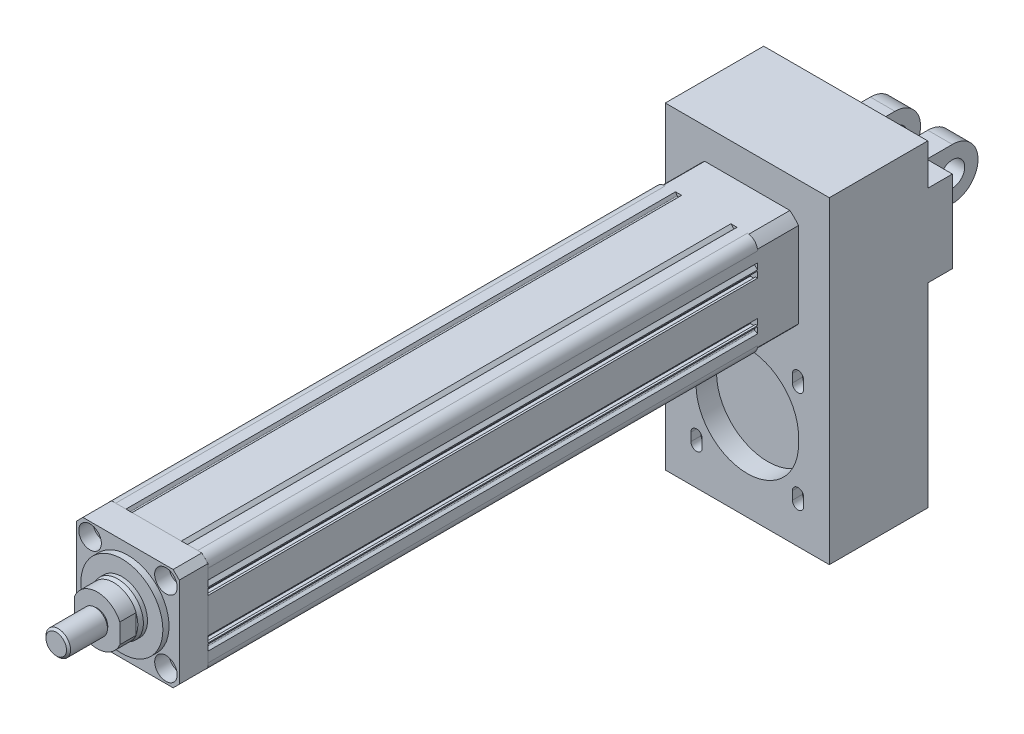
from build123d import *

# Parameters (mm, degrees)
SKETCH_1_R           = 20
SKETCH_1_R_2         = 2.75
EXTRUDE_1_DEPTH      = 268
FILLET_1_R           = 5
EXTRUDE_2_DEPTH      = 14
SKETCH_3_R           = 20
EXTRUDE_3_DEPTH      = 3
SKETCH_5_R           = 12.5
EXTRUDE_4_DEPTH      = 4
CHAMFER_1_SIZE       = 2
CHAMFER_1_SIZE2      = 0.7
EXTRUDE_5_DEPTH      = 8
SKETCH_7_R           = 5.15
EXTRUDE_6_DEPTH      = 1
SKETCH_8_R           = 6
EXTRUDE_7_DEPTH      = 19
CHAMFER_2_SIZE       = 1
SKETCH_23_W          = 50
SKETCH_23_H          = 50
EXTRUDE_8_DEPTH      = 20
SKETCH_24_R          = 42.5
SKETCH_24_R_2        = 32.5
CUT_EXTRUDE_1_DEPTH  = 20
SKETCH_4_R           = 3.5
CUT_EXTRUDE_5_DEPTH  = 30
SKETCH_4_6_R         = 5.5
CUT_EXTRUDE_6_DEPTH  = 7
SKETCH_35_W          = 80
SKETCH_35_H          = 155
EXTRUDE_10_DEPTH     = 48
CUT_EXTRUDE_11_DEPTH = 10
CUT_EXTRUDE_12_DEPTH = 10
CUT_EXTRUDE_START    = 10
CUT_EXTRUDE_13_DEPTH = 5
SKETCH_36_W          = 80
SKETCH_36_H          = 40
EXTRUDE_11_DEPTH     = 12
SKETCH_36_3_W        = 12
SKETCH_36_3_H        = 25
EXTRUDE_12_DEPTH     = 44.5
SKETCH_38_R          = 6
CUT_EXTRUDE_14_DEPTH = 44
CHAMFER_3_SIZE       = 2


with BuildPart() as part:
    # Sketch 1 → Extrude 1 (new body)
    with BuildSketch(Plane.XY):
        with BuildLine():
            Line((-25, 25), (-15, 25))
            Line((-15, 25), (-14.227730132, 23.662389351))
            ThreePointArc((-14.227730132, 23.662389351), (-13.859980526, 23.416666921), (-13.441164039, 23.558835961))
            Line((-13.441164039, 23.558835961), (-12, 25))
            Line((-12, 25), (12, 25))
            Line((12, 25), (13.441164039, 23.558835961))
            ThreePointArc((13.441164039, 23.558835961), (13.859980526, 23.416666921), (14.227730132, 23.662389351))
            Line((14.227730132, 23.662389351), (15, 25))
            Line((15, 25), (25, 25))
            Line((25, 25), (25, 15))
            Line((25, 15), (23.662389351, 14.227730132))
            ThreePointArc((23.662389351, 14.227730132), (23.416666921, 13.859980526), (23.558835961, 13.441164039))
            Line((23.558835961, 13.441164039), (25, 12))
            Line((25, 12), (25, 11.5))
            Line((25, 11.5), (24, 11.5))
            Line((24, 11.5), (24, 12.4))
            Line((24, 12.4), (21.5, 12.4))
            Line((21.5, 12.4), (21.5, 7.6))
            Line((21.5, 7.6), (24, 7.6))
            Line((24, 7.6), (24, 8.5))
            Line((24, 8.5), (25, 8.5))
            Line((25, 8.5), (25, -8.5))
            Line((25, -8.5), (24, -8.5))
            Line((24, -8.5), (24, -7.6))
            Line((24, -7.6), (21.5, -7.6))
            Line((21.5, -7.6), (21.5, -12.4))
            Line((21.5, -12.4), (24, -12.4))
            Line((24, -12.4), (24, -11.5))
            Line((24, -11.5), (25, -11.5))
            Line((25, -11.5), (25, -12))
            Line((25, -12), (23.558835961, -13.441164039))
            ThreePointArc((23.558835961, -13.441164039), (23.416666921, -13.859980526), (23.662389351, -14.227730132))
            Line((23.662389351, -14.227730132), (25, -15))
            Line((25, -15), (25, -25))
            Line((25, -25), (15, -25))
            Line((15, -25), (14.227730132, -23.662389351))
            ThreePointArc((14.227730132, -23.662389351), (13.859980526, -23.416666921), (13.441164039, -23.558835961))
            Line((13.441164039, -23.558835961), (12, -25))
            Line((12, -25), (11.5, -25))
            Line((11.5, -25), (11.5, -24))
            Line((11.5, -24), (12.4, -24))
            Line((12.4, -24), (12.4, -21.5))
            Line((12.4, -21.5), (7.6, -21.5))
            Line((7.6, -21.5), (7.6, -24))
            Line((7.6, -24), (8.5, -24))
            Line((8.5, -24), (8.5, -25))
            Line((8.5, -25), (-8.5, -25))
            Line((-8.5, -25), (-8.5, -24))
            Line((-8.5, -24), (-7.6, -24))
            Line((-7.6, -24), (-7.6, -21.5))
            Line((-7.6, -21.5), (-12.4, -21.5))
            Line((-12.4, -21.5), (-12.4, -24))
            Line((-12.4, -24), (-11.5, -24))
            Line((-11.5, -24), (-11.5, -25))
            Line((-11.5, -25), (-12, -25))
            Line((-12, -25), (-13.441164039, -23.558835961))
            ThreePointArc((-13.441164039, -23.558835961), (-13.859980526, -23.416666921), (-14.227730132, -23.662389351))
            Line((-14.227730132, -23.662389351), (-15, -25))
            Line((-15, -25), (-25, -25))
            Line((-25, -25), (-25, -15))
            Line((-25, -15), (-23.662389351, -14.227730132))
            ThreePointArc((-23.662389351, -14.227730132), (-23.416666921, -13.859980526), (-23.558835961, -13.441164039))
            Line((-23.558835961, -13.441164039), (-25, -12))
            Line((-25, -12), (-25, -11.5))
            Line((-25, -11.5), (-24, -11.5))
            Line((-24, -11.5), (-24, -12.4))
            Line((-24, -12.4), (-21.5, -12.4))
            Line((-21.5, -12.4), (-21.5, -7.6))
            Line((-21.5, -7.6), (-24, -7.6))
            Line((-24, -7.6), (-24, -8.5))
            Line((-24, -8.5), (-25, -8.5))
            Line((-25, -8.5), (-25, 8.5))
            Line((-25, 8.5), (-24, 8.5))
            Line((-24, 8.5), (-24, 7.6))
            Line((-24, 7.6), (-21.5, 7.6))
            Line((-21.5, 7.6), (-21.5, 12.4))
            Line((-21.5, 12.4), (-24, 12.4))
            Line((-24, 12.4), (-24, 11.5))
            Line((-24, 11.5), (-25, 11.5))
            Line((-25, 11.5), (-25, 12))
            Line((-25, 12), (-23.558835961, 13.441164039))
            ThreePointArc((-23.558835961, 13.441164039), (-23.416666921, 13.859980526), (-23.662389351, 14.227730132))
            Line((-23.662389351, 14.227730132), (-25, 15))
            Line((-25, 15), (-25, 25))
        make_face()
        Circle(SKETCH_1_R, mode=Mode.SUBTRACT)
        with Locations((-18.5, 18.5)):
            Circle(SKETCH_1_R_2, mode=Mode.SUBTRACT)
        with Locations((18.5, 18.5)):
            Circle(SKETCH_1_R_2, mode=Mode.SUBTRACT)
        with Locations((18.5, -18.5)):
            Circle(SKETCH_1_R_2, mode=Mode.SUBTRACT)
        with Locations((-18.5, -18.5)):
            Circle(SKETCH_1_R_2, mode=Mode.SUBTRACT)
        with BuildLine():
            Line((-13.868836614, 23), (-5, 23))
            ThreePointArc((-5, 23), (-4.502985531, 22.554558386), (-4.891534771, 22.01190647))
            ThreePointArc((-4.891534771, 22.01190647), (-10.498377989, 19.955831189), (-15.368836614, 16.5))
            Line((-15.368836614, 16.5), (-15.368836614, 21.5))
            Line((-15.368836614, 21.5), (-13.868836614, 23))
        make_face(mode=Mode.SUBTRACT)
        with BuildLine():
            Line((15.368836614, 16.5), (15.368836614, 21.5))
            Line((15.368836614, 21.5), (13.868836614, 23))
            Line((13.868836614, 23), (5, 23))
            ThreePointArc((5, 23), (4.502985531, 22.554558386), (4.891534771, 22.01190647))
            ThreePointArc((4.891534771, 22.01190647), (10.498377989, 19.955831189), (15.368836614, 16.5))
        make_face(mode=Mode.SUBTRACT)
    extrude(amount=EXTRUDE_1_DEPTH)

    # Fillet 1
    fillet_1_edges = [part.edges().sort_by_distance(p)[0] for p in [
        (-25, 25, 134),
        (25, 25, 134),
        (25, -25, 134),
        (-25, -25, 134),
    ]]
    fillet(fillet_1_edges, radius=FILLET_1_R)

    # Sketch 23 → Extrude 8 (add)
    with BuildSketch(Plane(origin=(0, 0, 0), x_dir=(-1, 0, 0), z_dir=(0, 0, -1))):
        Rectangle(SKETCH_23_W, SKETCH_23_H)
    extrude(amount=EXTRUDE_8_DEPTH)

    # Sketch 24 → Cut-Extrude 1 (cut)
    with BuildSketch(Plane(origin=(0, 0, -20), x_dir=(-1, 0, 0), z_dir=(0, 0, -1))):
        Circle(SKETCH_24_R)
        Circle(SKETCH_24_R_2, mode=Mode.SUBTRACT)
    extrude(amount=-CUT_EXTRUDE_1_DEPTH, mode=Mode.SUBTRACT)

    # Sketch 27 → Hole Wizard M6 _1 (revolve, cut)
    with BuildSketch(Plane(origin=(0, -25, -12), x_dir=(0, 0, -1), z_dir=(1, 0, 0))):
        Polygon((0, 0), (0, 8.502151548), (2.5, 7), (2.5, 0), align=None)
    revolve(axis=Axis((0, -31.35, -12), (0, 1, 0)), mode=Mode.SUBTRACT)


with BuildPart() as body_2:
    # Sketch 2 → Extrude 2 (new body)
    with BuildSketch(Plane.XY.offset(268)):
        Polygon((-25, 22), (-22, 25), (22, 25), (25, 22), (25, -22), (22, -25), (-22, -25), (-25, -22), align=None)
    extrude(amount=EXTRUDE_2_DEPTH)


with BuildPart() as body_3:
    # Sketch 3 → Extrude 3 (new body)
    with BuildSketch(Plane.XY.offset(282)):
        Circle(SKETCH_3_R)
    extrude(amount=EXTRUDE_3_DEPTH)


with BuildPart() as body_4:
    # Sketch 5 → Extrude 4 (new body)
    with BuildSketch(Plane.XY.offset(285)):
        Circle(SKETCH_5_R)
    extrude(amount=EXTRUDE_4_DEPTH)

    # Chamfer 1
    chamfer_1_edges = [body_4.edges().sort_by_distance(p)[0] for p in [
        (-12.5, 0, 289),
    ]]
    chamfer_1_side = [body_4.faces().sort_by_distance(p)[0] for p in [
        (-12.5, 0, 287),
    ]]
    chamfer(chamfer_1_edges, length=CHAMFER_1_SIZE, length2=CHAMFER_1_SIZE2, reference=chamfer_1_side[0])


with BuildPart() as body_5:
    # Sketch 6 → Extrude 5 (new body)
    with BuildSketch(Plane.XY.offset(289)):
        with BuildLine():
            Line((-11, 4.795831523), (-11, -4.795831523))
            ThreePointArc((-11, -4.795831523), (0, -12), (11, -4.795831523))
            Line((11, -4.795831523), (11, 4.795831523))
            ThreePointArc((11, 4.795831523), (0, 12), (-11, 4.795831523))
        make_face()
    extrude(amount=EXTRUDE_5_DEPTH)


with BuildPart() as body_6:
    # Sketch 7 → Extrude 6 (new body)
    with BuildSketch(Plane.XY.offset(297)):
        Circle(SKETCH_7_R)
    extrude(amount=EXTRUDE_6_DEPTH)


with BuildPart() as body_7:
    # Sketch 8 → Extrude 7 (new body)
    with BuildSketch(Plane.XY.offset(298)):
        Circle(SKETCH_8_R)
    extrude(amount=EXTRUDE_7_DEPTH)

    # Chamfer 2
    chamfer_2_edges = [body_7.edges().sort_by_distance(p)[0] for p in [
        (-6, 0, 317),
    ]]
    chamfer(chamfer_2_edges, length=CHAMFER_2_SIZE)


with BuildPart() as cut_extrude_5_tool:
    # Sketch 4 → Cut-Extrude 5 (new body)
    with BuildSketch(Plane.XY.offset(282)):
        with Locations((-35, 17.5)):
            Circle(SKETCH_4_R)
        with Locations((-18.5, 18.5)):
            Circle(SKETCH_4_R)
        with Locations(Location((-18.5, -18.5, 0), (0, 0, 180))):
            Circle(SKETCH_4_R)
        with Locations((-35, -17.5)):
            Circle(SKETCH_4_R)
        with Locations((35, -17.5)):
            Circle(SKETCH_4_R)
        with Locations((18.5, -18.5)):
            Circle(SKETCH_4_R)
        with Locations(Location((18.5, 18.5, 0), (0, 0, 180))):
            Circle(SKETCH_4_R)
        with Locations((35, 17.5)):
            Circle(SKETCH_4_R)
    extrude(amount=-CUT_EXTRUDE_5_DEPTH)


with BuildPart() as part_1:
    add(part.part)

    # Cut-Extrude 5: cut by cut_extrude_5_tool
    add(cut_extrude_5_tool.part, mode=Mode.SUBTRACT)

    # Sketch 35 → Extrude 10 (add)
    with BuildSketch(Plane(origin=(0, 0, -20), x_dir=(-1, 0, 0), z_dir=(0, 0, -1))):
        with Locations((0, -37.5)):
            Rectangle(SKETCH_35_W, SKETCH_35_H)
    extrude(amount=EXTRUDE_10_DEPTH)

    # Sketch 35_3 → Cut-Extrude 11 (cut)
    with BuildSketch(Plane(origin=(0, 0, -20), x_dir=(-1, 0, 0), z_dir=(0, 0, -1))):
        with BuildLine():
            Line((25, -68.5), (25, -71.5))
            ThreePointArc((25, -71.5), (-0.002360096, -96.499999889), (-24.999999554, -71.495279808))
            Line((-24.999999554, -71.495279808), (-24.999464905, -68.663567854))
            ThreePointArc((-24.999464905, -68.663567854), (-0.081784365, -43.500133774), (25, -68.5))
        make_face()
    extrude(amount=CUT_EXTRUDE_11_DEPTH, mode=Mode.SUBTRACT)

    # Sketch 35_4 → Cut-Extrude 12 (cut)
    with BuildSketch(Plane(origin=(0, 0, -20), x_dir=(-1, 0, 0), z_dir=(0, 0, -1))):
        with BuildLine():
            Line((27.498737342, -92.748737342), (27.498737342, -96.748737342))
            ThreePointArc((27.498737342, -96.748737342), (24.748737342, -99.498737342), (21.998737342, -96.748737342))
            Line((21.998737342, -96.748737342), (21.998737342, -92.748737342))
            ThreePointArc((21.998737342, -92.748737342), (24.748737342, -89.998737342), (27.498737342, -92.748737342))
        make_face()
        with BuildLine():
            Line((-27.498737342, -92.748737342), (-27.498737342, -96.748737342))
            ThreePointArc((-27.498737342, -96.748737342), (-24.748737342, -99.498737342), (-21.998737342, -96.748737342))
            Line((-21.998737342, -96.748737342), (-21.998737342, -92.748737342))
            ThreePointArc((-21.998737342, -92.748737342), (-24.748737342, -89.998737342), (-27.498737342, -92.748737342))
        make_face()
        with BuildLine():
            Line((-27.498737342, -47.251262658), (-27.498737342, -43.251262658))
            ThreePointArc((-27.498737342, -43.251262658), (-24.748737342, -40.501262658), (-21.998737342, -43.251262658))
            Line((-21.998737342, -43.251262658), (-21.998737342, -47.251262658))
            ThreePointArc((-21.998737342, -47.251262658), (-24.748737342, -50.001262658), (-27.498737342, -47.251262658))
        make_face()
        with BuildLine():
            Line((27.498737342, -47.251262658), (27.498737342, -43.251262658))
            ThreePointArc((27.498737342, -43.251262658), (24.748737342, -40.501262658), (21.998737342, -43.251262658))
            Line((21.998737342, -43.251262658), (21.998737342, -47.251262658))
            ThreePointArc((21.998737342, -47.251262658), (24.748737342, -50.001262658), (27.498737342, -47.251262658))
        make_face()
    extrude(amount=CUT_EXTRUDE_12_DEPTH, mode=Mode.SUBTRACT)

    # Sketch 35_5 → Cut-Extrude 13 (cut)
    with BuildSketch(Plane(origin=(0, 0, -20), x_dir=(-1, 0, 0), z_dir=(0, 0, -1)).offset(CUT_EXTRUDE_START)):
        with BuildLine():
            Line((28.848737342, -91.848737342), (28.848737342, -97.648737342))
            ThreePointArc((28.848737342, -97.648737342), (24.748737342, -101.748737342), (20.648737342, -97.648737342))
            Line((20.648737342, -97.648737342), (20.648737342, -91.848737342))
            ThreePointArc((20.648737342, -91.848737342), (24.748737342, -87.748737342), (28.848737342, -91.848737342))
        make_face()
        with BuildLine():
            Line((-28.848737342, -91.848737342), (-28.848737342, -97.648737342))
            ThreePointArc((-28.848737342, -97.648737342), (-24.748737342, -101.748737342), (-20.648737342, -97.648737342))
            Line((-20.648737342, -97.648737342), (-20.648737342, -91.848737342))
            ThreePointArc((-20.648737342, -91.848737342), (-24.748737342, -87.748737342), (-28.848737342, -91.848737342))
        make_face()
        with BuildLine():
            Line((-28.848737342, -48.151262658), (-28.848737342, -42.351262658))
            ThreePointArc((-28.848737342, -42.351262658), (-24.748737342, -38.251262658), (-20.648737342, -42.351262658))
            Line((-20.648737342, -42.351262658), (-20.648737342, -48.151262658))
            ThreePointArc((-20.648737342, -48.151262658), (-24.748737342, -52.251262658), (-28.848737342, -48.151262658))
        make_face()
        with BuildLine():
            Line((28.848737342, -48.151262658), (28.848737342, -42.351262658))
            ThreePointArc((28.848737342, -42.351262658), (24.748737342, -38.251262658), (20.648737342, -42.351262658))
            Line((20.648737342, -42.351262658), (20.648737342, -48.151262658))
            ThreePointArc((20.648737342, -48.151262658), (24.748737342, -52.251262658), (28.848737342, -48.151262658))
        make_face()
    extrude(amount=-CUT_EXTRUDE_13_DEPTH, mode=Mode.SUBTRACT)



with BuildPart() as body_2_1:
    add(body_2.part)

    # Cut-Extrude 5: cut by cut_extrude_5_tool
    add(cut_extrude_5_tool.part, mode=Mode.SUBTRACT)

    # Sketch 4_6 → Cut-Extrude 6 (cut)
    with BuildSketch(Plane.XY.offset(282)):
        with Locations((-18.5, 18.5)):
            Circle(SKETCH_4_6_R)
        with Locations(Location((-18.5, -18.5, 0), (0, 0, 180))):
            Circle(SKETCH_4_6_R)
        with Locations((18.5, -18.5)):
            Circle(SKETCH_4_6_R)
        with Locations(Location((18.5, 18.5, 0), (0, 0, 180))):
            Circle(SKETCH_4_6_R)
    extrude(amount=-CUT_EXTRUDE_6_DEPTH, mode=Mode.SUBTRACT)


with BuildPart() as body_8:
    # Sketch 36 → Extrude 11 (new body)
    with BuildSketch(Plane(origin=(0, 0, -68), x_dir=(-1, 0, 0), z_dir=(0, 0, -1))):
        Rectangle(SKETCH_36_W, SKETCH_36_H)
    extrude(amount=EXTRUDE_11_DEPTH)


with BuildPart() as part_2:
    add(part_1.part)

    add(body_8.part)  # Extrude 12 merges body 8
    # Sketch 36_3 → Extrude 12 (add)
    with BuildSketch(Plane(origin=(0, 0, -68), x_dir=(-1, 0, 0), z_dir=(0, 0, -1))):
        with Locations((14, 0)):
            Rectangle(SKETCH_36_3_W, SKETCH_36_3_H)
        with Locations((-14, 0)):
            Rectangle(SKETCH_36_3_W, SKETCH_36_3_H)
    extrude(amount=EXTRUDE_12_DEPTH)

    # Sketch 38 → Cut-Extrude 14 (cut)
    with BuildSketch(Plane(origin=(20, 0, 0), x_dir=(0, 0, -1), z_dir=(1, 0, 0))):
        with Locations((100, 0)):
            Circle(SKETCH_38_R)
        with BuildLine():
            Line((100, -12.5), (154.900531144, -18.010050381))
            Line((154.900531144, -18.010050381), (137.338158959, 26.966756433))
            Line((137.338158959, 26.966756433), (100, 12.5))
            ThreePointArc((100, 12.5), (112.5, 0), (100, -12.5))
        make_face()
    extrude(amount=-CUT_EXTRUDE_14_DEPTH, mode=Mode.SUBTRACT)

    # Chamfer 3
    chamfer_3_edges = [part_2.edges().sort_by_distance(p)[0] for p in [
        (-14, -12.5, -80),
        (-8, 0, -80),
        (-20, 0, -80),
        (-14, 12.5, -80),
        (14, -12.5, -80),
        (20, 0, -80),
        (14, 12.5, -80),
        (8, 0, -80),
    ]]
    chamfer(chamfer_3_edges, length=CHAMFER_3_SIZE)


solid = Compound([body_3.part, body_4.part, body_5.part, body_6.part, body_7.part, body_2_1.part, part_2.part])
